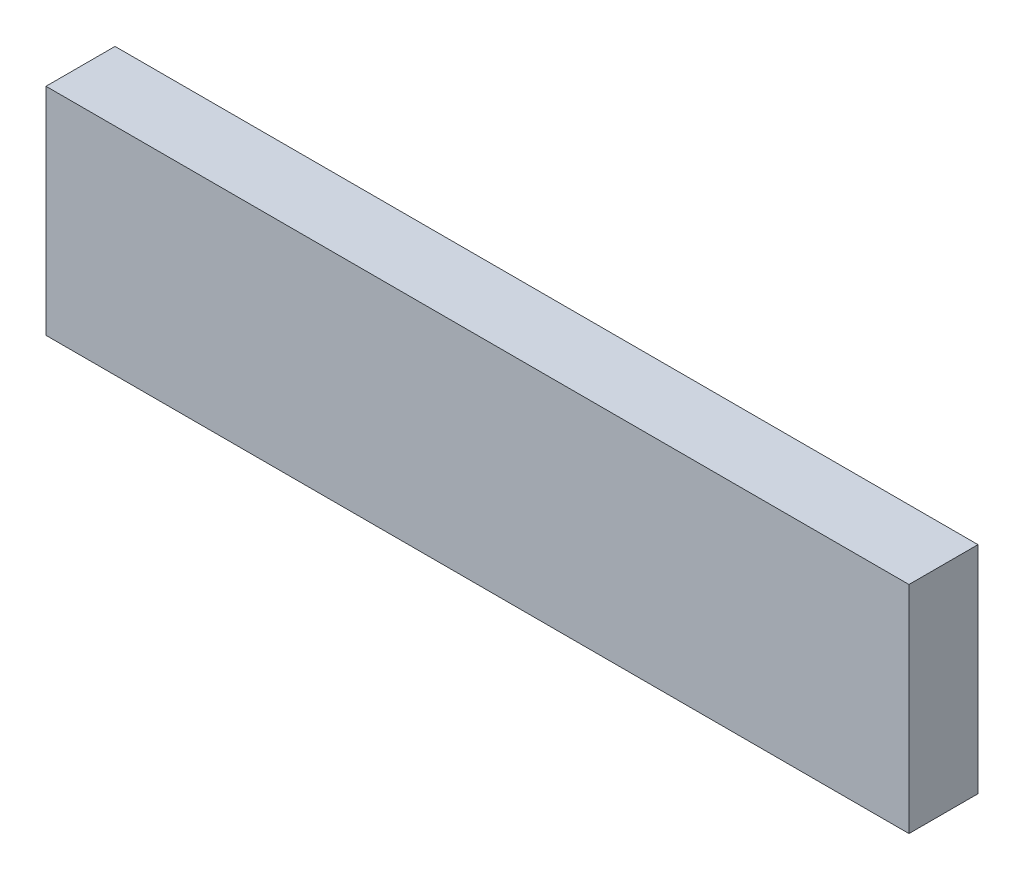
ISO-10303-21;
HEADER;
FILE_DESCRIPTION(('STEP AP214'),'2;1');
FILE_NAME('part.step','',(''),(''),'','','');
FILE_SCHEMA(('AUTOMOTIVE_DESIGN { 1 0 10303 214 1 1 1 1 }'));
ENDSEC;
DATA;
#1=APPLICATION_CONTEXT('core data for automotive mechanical design processes');
#2=APPLICATION_PROTOCOL_DEFINITION('international standard','automotive_design',2000,#1);
#3=PRODUCT_CONTEXT('',#1,'mechanical');
#4=PRODUCT('Part','Part','',(#3));
#5=PRODUCT_RELATED_PRODUCT_CATEGORY('part','',(#4));
#6=PRODUCT_DEFINITION_FORMATION('','',#4);
#7=PRODUCT_DEFINITION_CONTEXT('part definition',#1,'design');
#8=PRODUCT_DEFINITION('design','',#6,#7);
#9=PRODUCT_DEFINITION_SHAPE('','',#8);
#10=(LENGTH_UNIT() NAMED_UNIT(*) SI_UNIT(.MILLI.,.METRE.));
#11=(NAMED_UNIT(*) PLANE_ANGLE_UNIT() SI_UNIT($,.RADIAN.));
#12=(NAMED_UNIT(*) SI_UNIT($,.STERADIAN.) SOLID_ANGLE_UNIT());
#13=UNCERTAINTY_MEASURE_WITH_UNIT(LENGTH_MEASURE(1.E-05),#10,'distance_accuracy_value','');
#14=(GEOMETRIC_REPRESENTATION_CONTEXT(3) GLOBAL_UNCERTAINTY_ASSIGNED_CONTEXT((#13)) GLOBAL_UNIT_ASSIGNED_CONTEXT((#10,
#11,#12)) REPRESENTATION_CONTEXT('',''));
#15=CARTESIAN_POINT('',(0.,0.,0.));
#16=DIRECTION('',(0.,0.,1.));
#17=DIRECTION('',(1.,0.,0.));
#18=AXIS2_PLACEMENT_3D('',#15,#16,#17);
#19=CARTESIAN_POINT('',(100.,0.,0.));
#20=DIRECTION('',(0.,0.,-1.));
#21=DIRECTION('',(-1.,0.,0.));
#22=AXIS2_PLACEMENT_3D('',#19,#20,#21);
#23=PLANE('',#22);
#24=DIRECTION('',(0.,-1.,0.));
#25=VECTOR('',#24,1.);
#26=CARTESIAN_POINT('',(0.,0.,0.));
#27=LINE('',#26,#25);
#28=CARTESIAN_POINT('',(0.,25.,0.));
#29=VERTEX_POINT('',#28);
#30=CARTESIAN_POINT('',(0.,0.,0.));
#31=VERTEX_POINT('',#30);
#32=EDGE_CURVE('E83',#29,#31,#27,.T.);
#33=ORIENTED_EDGE('',*,*,#32,.T.);
#34=DIRECTION('',(-1.,0.,0.));
#35=VECTOR('',#34,1.);
#36=CARTESIAN_POINT('',(100.,0.,0.));
#37=LINE('',#36,#35);
#38=CARTESIAN_POINT('',(100.,0.,0.));
#39=VERTEX_POINT('',#38);
#40=EDGE_CURVE('E11',#39,#31,#37,.T.);
#41=ORIENTED_EDGE('',*,*,#40,.F.);
#42=DIRECTION('',(0.,-1.,0.));
#43=VECTOR('',#42,1.);
#44=CARTESIAN_POINT('',(100.,0.,0.));
#45=LINE('',#44,#43);
#46=CARTESIAN_POINT('',(100.,25.,0.));
#47=VERTEX_POINT('',#46);
#48=EDGE_CURVE('E105',#47,#39,#45,.T.);
#49=ORIENTED_EDGE('',*,*,#48,.F.);
#50=DIRECTION('',(-1.,0.,0.));
#51=VECTOR('',#50,1.);
#52=CARTESIAN_POINT('',(100.,25.,0.));
#53=LINE('',#52,#51);
#54=EDGE_CURVE('E96',#47,#29,#53,.T.);
#55=ORIENTED_EDGE('',*,*,#54,.T.);
#56=EDGE_LOOP('',(#33,#41,#49,#55));
#57=FACE_BOUND('',#56,.T.);
#58=ADVANCED_FACE('F38',(#57),#23,.F.);
#59=CARTESIAN_POINT('',(100.,0.,0.));
#60=DIRECTION('',(0.,1.,0.));
#61=DIRECTION('',(0.,0.,1.));
#62=AXIS2_PLACEMENT_3D('',#59,#60,#61);
#63=PLANE('',#62);
#64=DIRECTION('',(0.,0.,-1.));
#65=VECTOR('',#64,1.);
#66=CARTESIAN_POINT('',(0.,0.,0.));
#67=LINE('',#66,#65);
#68=CARTESIAN_POINT('',(0.,0.,-8.00000000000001));
#69=VERTEX_POINT('',#68);
#70=EDGE_CURVE('E79',#31,#69,#67,.T.);
#71=ORIENTED_EDGE('',*,*,#70,.T.);
#72=DIRECTION('',(-1.,0.,0.));
#73=VECTOR('',#72,1.);
#74=CARTESIAN_POINT('',(100.,0.,-8.00000000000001));
#75=LINE('',#74,#73);
#76=CARTESIAN_POINT('',(100.,0.,-8.00000000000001));
#77=VERTEX_POINT('',#76);
#78=EDGE_CURVE('E46',#77,#69,#75,.T.);
#79=ORIENTED_EDGE('',*,*,#78,.F.);
#80=DIRECTION('',(0.,0.,-1.));
#81=VECTOR('',#80,1.);
#82=CARTESIAN_POINT('',(100.,0.,0.));
#83=LINE('',#82,#81);
#84=EDGE_CURVE('E92',#39,#77,#83,.T.);
#85=ORIENTED_EDGE('',*,*,#84,.F.);
#86=ORIENTED_EDGE('',*,*,#40,.T.);
#87=EDGE_LOOP('',(#71,#79,#85,#86));
#88=FACE_BOUND('',#87,.T.);
#89=ADVANCED_FACE('F91',(#88),#63,.F.);
#90=CARTESIAN_POINT('',(100.,0.,-8.00000000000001));
#91=DIRECTION('',(0.,0.,1.));
#92=DIRECTION('',(1.,0.,0.));
#93=AXIS2_PLACEMENT_3D('',#90,#91,#92);
#94=PLANE('',#93);
#95=DIRECTION('',(0.,1.,0.));
#96=VECTOR('',#95,1.);
#97=CARTESIAN_POINT('',(0.,0.,-8.00000000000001));
#98=LINE('',#97,#96);
#99=CARTESIAN_POINT('',(0.,25.,-8.00000000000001));
#100=VERTEX_POINT('',#99);
#101=EDGE_CURVE('E84',#69,#100,#98,.T.);
#102=ORIENTED_EDGE('',*,*,#101,.T.);
#103=DIRECTION('',(-1.,0.,0.));
#104=VECTOR('',#103,1.);
#105=CARTESIAN_POINT('',(100.,25.,-8.00000000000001));
#106=LINE('',#105,#104);
#107=CARTESIAN_POINT('',(100.,25.,-8.00000000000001));
#108=VERTEX_POINT('',#107);
#109=EDGE_CURVE('E116',#108,#100,#106,.T.);
#110=ORIENTED_EDGE('',*,*,#109,.F.);
#111=DIRECTION('',(0.,1.,0.));
#112=VECTOR('',#111,1.);
#113=CARTESIAN_POINT('',(100.,0.,-8.00000000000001));
#114=LINE('',#113,#112);
#115=EDGE_CURVE('E58',#77,#108,#114,.T.);
#116=ORIENTED_EDGE('',*,*,#115,.F.);
#117=ORIENTED_EDGE('',*,*,#78,.T.);
#118=EDGE_LOOP('',(#102,#110,#116,#117));
#119=FACE_BOUND('',#118,.T.);
#120=ADVANCED_FACE('F121',(#119),#94,.F.);
#121=CARTESIAN_POINT('',(100.,25.,0.));
#122=DIRECTION('',(0.,-1.,0.));
#123=DIRECTION('',(0.,0.,-1.));
#124=AXIS2_PLACEMENT_3D('',#121,#122,#123);
#125=PLANE('',#124);
#126=DIRECTION('',(0.,0.,1.));
#127=VECTOR('',#126,1.);
#128=CARTESIAN_POINT('',(0.,25.,0.));
#129=LINE('',#128,#127);
#130=EDGE_CURVE('E102',#100,#29,#129,.T.);
#131=ORIENTED_EDGE('',*,*,#130,.T.);
#132=ORIENTED_EDGE('',*,*,#54,.F.);
#133=DIRECTION('',(0.,0.,1.));
#134=VECTOR('',#133,1.);
#135=CARTESIAN_POINT('',(100.,25.,0.));
#136=LINE('',#135,#134);
#137=EDGE_CURVE('E53',#108,#47,#136,.T.);
#138=ORIENTED_EDGE('',*,*,#137,.F.);
#139=ORIENTED_EDGE('',*,*,#109,.T.);
#140=EDGE_LOOP('',(#131,#132,#138,#139));
#141=FACE_BOUND('',#140,.T.);
#142=ADVANCED_FACE('F123',(#141),#125,.F.);
#143=CARTESIAN_POINT('',(100.,25.,0.));
#144=DIRECTION('',(-1.,0.,0.));
#145=DIRECTION('',(0.,0.,1.));
#146=AXIS2_PLACEMENT_3D('',#143,#144,#145);
#147=PLANE('',#146);
#148=ORIENTED_EDGE('',*,*,#48,.T.);
#149=ORIENTED_EDGE('',*,*,#84,.T.);
#150=ORIENTED_EDGE('',*,*,#115,.T.);
#151=ORIENTED_EDGE('',*,*,#137,.T.);
#152=EDGE_LOOP('',(#148,#149,#150,#151));
#153=FACE_BOUND('',#152,.T.);
#154=ADVANCED_FACE('F124',(#153),#147,.F.);
#155=CARTESIAN_POINT('',(0.,25.,0.));
#156=DIRECTION('',(-1.,0.,0.));
#157=DIRECTION('',(0.,0.,1.));
#158=AXIS2_PLACEMENT_3D('',#155,#156,#157);
#159=PLANE('',#158);
#160=ORIENTED_EDGE('',*,*,#32,.F.);
#161=ORIENTED_EDGE('',*,*,#130,.F.);
#162=ORIENTED_EDGE('',*,*,#101,.F.);
#163=ORIENTED_EDGE('',*,*,#70,.F.);
#164=EDGE_LOOP('',(#160,#161,#162,#163));
#165=FACE_BOUND('',#164,.T.);
#166=ADVANCED_FACE('F80',(#165),#159,.T.);
#167=CLOSED_SHELL('',(#58,#89,#120,#142,#154,#166));
#168=MANIFOLD_SOLID_BREP('B2',#167);
#169=ADVANCED_BREP_SHAPE_REPRESENTATION('',(#18,#168),#14);
#170=SHAPE_DEFINITION_REPRESENTATION(#9,#169);
ENDSEC;
END-ISO-10303-21;
